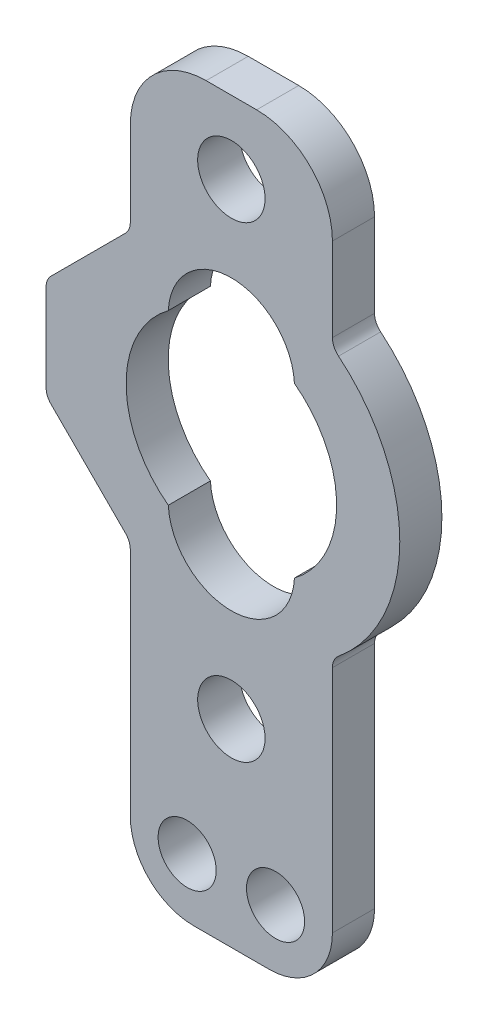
from build123d import *

# Parameters (mm, degrees)
ESQUISSE1_R          = 3.45
ESQUISSE1_R_2        = 4
BASE_EXTRUSION_DEPTH = 5


with BuildPart() as part:
    # Esquisse1 → Base-Extrusion (new body)
    with BuildSketch(Plane.XY):
        with BuildLine():
            Line((-4.5, 0), (4.5, 0))
            ThreePointArc((4.5, 0), (9.803300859, 2.196699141), (12, 7.5))
            Line((12, 7.5), (12, 34.779437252))
            ThreePointArc((12, 34.779437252), (12.190931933, 35.632240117), (12.727272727, 36.322215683))
            ThreePointArc((12.727272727, 36.322215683), (20, 51.75), (12.727272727, 67.177784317))
            ThreePointArc((12.727272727, 67.177784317), (12.190931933, 67.867759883), (12, 68.720562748))
            Line((12, 68.720562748), (12, 78.65))
            ThreePointArc((12, 78.65), (9.363961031, 85.013961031), (3, 87.65))
            Line((3, 87.65), (-3, 87.65))
            ThreePointArc((-3, 87.65), (-9.363961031, 85.013961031), (-12, 78.65))
            Line((-12, 78.65), (-12, 68.578427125))
            ThreePointArc((-12, 68.578427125), (-12.152240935, 67.81306026), (-12.585786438, 67.164213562))
            Line((-12.585786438, 67.164213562), (-21.414213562, 58.335786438))
            ThreePointArc((-21.414213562, 58.335786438), (-21.847759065, 57.68693974), (-22, 56.921572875))
            Line((-22, 56.921572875), (-22, 46.578427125))
            ThreePointArc((-22, 46.578427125), (-21.847759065, 45.81306026), (-21.414213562, 45.164213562))
            Line((-21.414213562, 45.164213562), (-12.585786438, 36.335786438))
            ThreePointArc((-12.585786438, 36.335786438), (-12.152240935, 35.68693974), (-12, 34.921572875))
            Line((-12, 34.921572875), (-12, 7.5))
            ThreePointArc((-12, 7.5), (-9.803300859, 2.196699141), (-4.5, 0))
        make_face()
        with Locations((-5.25, 7)):
            Circle(ESQUISSE1_R, mode=Mode.SUBTRACT)
        with Locations(Location((5.25, 7, 0), (0, 0, 180))):
            Circle(ESQUISSE1_R, mode=Mode.SUBTRACT)
        with Locations((0, 23.5)):
            Circle(ESQUISSE1_R_2, mode=Mode.SUBTRACT)
        with Locations((0, 79)):
            Circle(ESQUISSE1_R_2, mode=Mode.SUBTRACT)
        with BuildLine():
            ThreePointArc((7.490249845, 41.742694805), (12.5, 51.75), (7.490249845, 61.757305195))
            ThreePointArc((7.490249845, 61.757305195), (0, 68.875), (-7.490249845, 61.757305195))
            ThreePointArc((-7.490249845, 61.757305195), (-12.5, 51.75), (-7.490249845, 41.742694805))
            ThreePointArc((-7.490249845, 41.742694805), (0, 34.625), (7.490249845, 41.742694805))
        make_face(mode=Mode.SUBTRACT)
    extrude(amount=BASE_EXTRUSION_DEPTH)


solid = part.part
